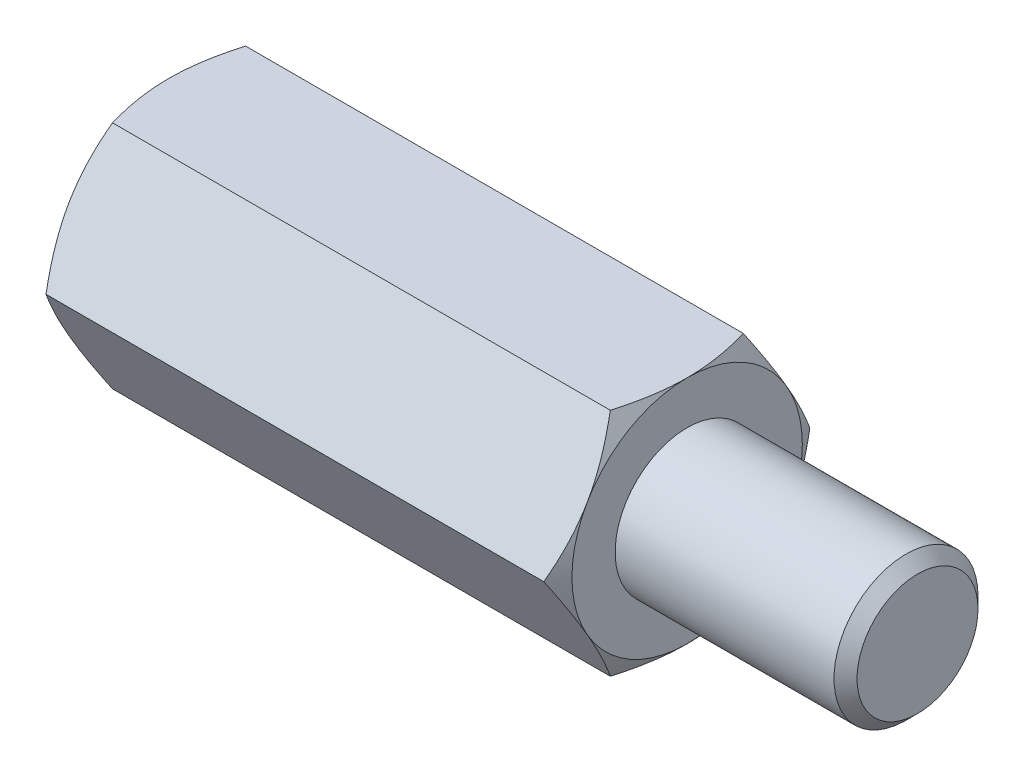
from build123d import *

# Parameters (mm, degrees)
EXTRUDE2_DEPTH = 9
SKETCH3_R      = 2.1
EXTRUDE3_DEPTH = 8
SKETCH5_R      = 2.5
EXTRUDE4_DEPTH = 8
CHAMFER1_SIZE  = 0.4


with BuildPart() as part:
    # Sketch1 → Extrude2 (new, symmetric)
    with BuildSketch(Plane(origin=(0, 0, 0), x_dir=(0, 0, -1), z_dir=(1, 0, 0))):
        Polygon((2.309401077, 4), (-2.309401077, 4), (-4.618802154, 0), (-2.309401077, -4), (2.309401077, -4), (4.618802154, 0), align=None)
    extrude(amount=EXTRUDE2_DEPTH, both=True)

    # Sketch2 → Cut-Revolve1 (revolve, cut)
    with BuildSketch(Plane.XY):
        with BuildLine():
            Line((-9, 4), (-7.5, 6.598076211))
            ThreePointArc((-7.5, 6.598076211), (-7.98810136, 7.776457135), (-9, 7))
            Line((-9, 7), (-9, 4))
        make_face()
    cut_revolve1 = revolve(axis=Axis((0, 0, 0), (1, 0, 0)), mode=Mode.SUBTRACT)

    # Mirror1: Cut-Revolve1 across plane
    add(cut_revolve1.mirror(Plane(origin=(0, 0, 0), x_dir=(0, 0, 1), z_dir=(1, 0, 0))), mode=Mode.SUBTRACT)

    # Sketch3 → Extrude3 (cut)
    with BuildSketch(Plane.ZY.offset(9)):
        Circle(SKETCH3_R)
    extrude(amount=-EXTRUDE3_DEPTH, mode=Mode.SUBTRACT)

    # Sketch4 → Cut-Revolve2 (revolve, cut)
    with BuildSketch(Plane.XY, mode=Mode.PRIVATE) as cut_revolve2_sk:
        Polygon((-1, 0), (-1, 2.1), (0.212435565, 0), align=None)
    revolve(cut_revolve2_sk.sketch.rotate(Axis((0.212435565, 0, 0), (-1, 0, 0)), 270), axis=Axis((0.212435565, 0, 0), (-1, 0, 0)), mode=Mode.SUBTRACT)

    # Sketch5 → Extrude4 (add)
    with BuildSketch(Plane(origin=(9, 0, 0), x_dir=(0, 0, -1), z_dir=(1, 0, 0))):
        Circle(SKETCH5_R)
    extrude(amount=EXTRUDE4_DEPTH)

    # Chamfer1
    chamfer1_edges = [part.edges().sort_by_distance(p)[0] for p in [
        (17, 0, 2.5),
    ]]
    chamfer(chamfer1_edges, length=CHAMFER1_SIZE)


solid = part.part
